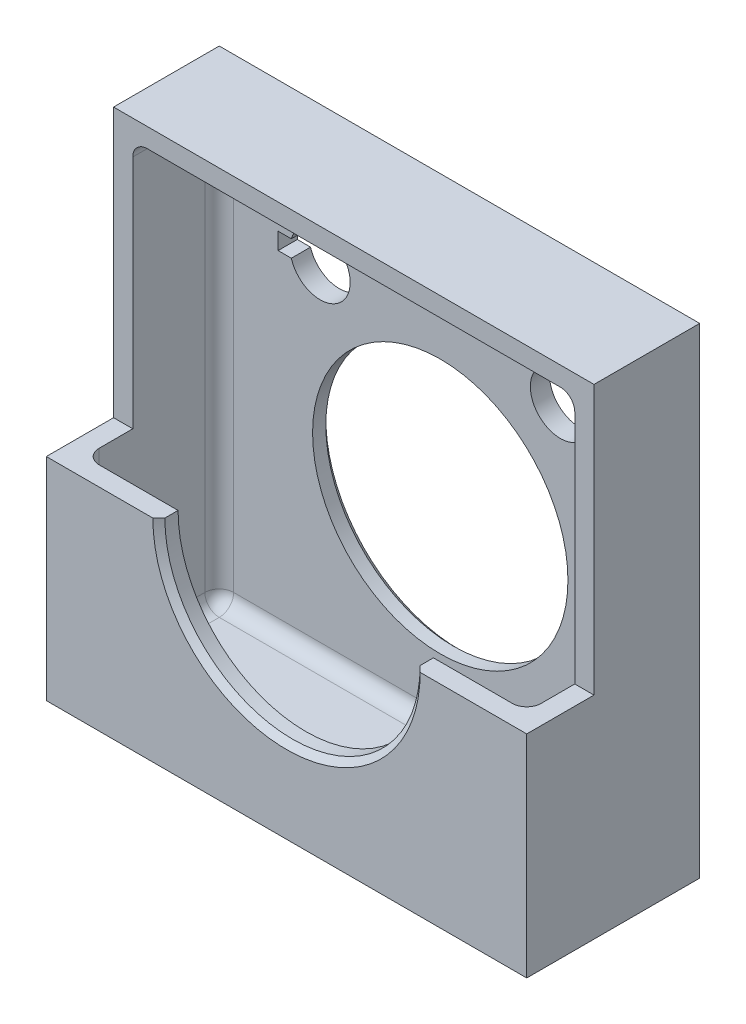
ISO-10303-21;
HEADER;
FILE_DESCRIPTION(('STEP AP214'),'2;1');
FILE_NAME('part.step','',(''),(''),'','','');
FILE_SCHEMA(('AUTOMOTIVE_DESIGN { 1 0 10303 214 1 1 1 1 }'));
ENDSEC;
DATA;
#1=APPLICATION_CONTEXT('core data for automotive mechanical design processes');
#2=APPLICATION_PROTOCOL_DEFINITION('international standard','automotive_design',2000,#1);
#3=PRODUCT_CONTEXT('',#1,'mechanical');
#4=PRODUCT('Part','Part','',(#3));
#5=PRODUCT_RELATED_PRODUCT_CATEGORY('part','',(#4));
#6=PRODUCT_DEFINITION_FORMATION('','',#4);
#7=PRODUCT_DEFINITION_CONTEXT('part definition',#1,'design');
#8=PRODUCT_DEFINITION('design','',#6,#7);
#9=PRODUCT_DEFINITION_SHAPE('','',#8);
#10=(LENGTH_UNIT() NAMED_UNIT(*) SI_UNIT(.MILLI.,.METRE.));
#11=(NAMED_UNIT(*) PLANE_ANGLE_UNIT() SI_UNIT($,.RADIAN.));
#12=(NAMED_UNIT(*) SI_UNIT($,.STERADIAN.) SOLID_ANGLE_UNIT());
#13=UNCERTAINTY_MEASURE_WITH_UNIT(LENGTH_MEASURE(1.E-05),#10,'distance_accuracy_value','');
#14=(GEOMETRIC_REPRESENTATION_CONTEXT(3) GLOBAL_UNCERTAINTY_ASSIGNED_CONTEXT((#13)) GLOBAL_UNIT_ASSIGNED_CONTEXT((#10,
#11,#12)) REPRESENTATION_CONTEXT('',''));
#15=CARTESIAN_POINT('',(0.,0.,0.));
#16=DIRECTION('',(0.,0.,1.));
#17=DIRECTION('',(1.,0.,0.));
#18=AXIS2_PLACEMENT_3D('',#15,#16,#17);
#19=CARTESIAN_POINT('',(0.,50.8,0.));
#20=DIRECTION('',(0.,0.,1.));
#21=DIRECTION('',(1.,0.,0.));
#22=AXIS2_PLACEMENT_3D('',#19,#20,#21);
#23=PLANE('',#22);
#24=DIRECTION('',(0.,1.,0.));
#25=VECTOR('',#24,1.);
#26=CARTESIAN_POINT('',(0.,0.,0.));
#27=LINE('',#26,#25);
#28=CARTESIAN_POINT('',(0.,0.,0.));
#29=VERTEX_POINT('',#28);
#30=CARTESIAN_POINT('',(0.,50.8,0.));
#31=VERTEX_POINT('',#30);
#32=EDGE_CURVE('E326',#29,#31,#27,.T.);
#33=ORIENTED_EDGE('',*,*,#32,.T.);
#34=DIRECTION('',(-1.,0.,0.));
#35=VECTOR('',#34,1.);
#36=CARTESIAN_POINT('',(50.8,50.8,0.));
#37=LINE('',#36,#35);
#38=CARTESIAN_POINT('',(50.8,50.8,0.));
#39=VERTEX_POINT('',#38);
#40=EDGE_CURVE('E346',#39,#31,#37,.T.);
#41=ORIENTED_EDGE('',*,*,#40,.F.);
#42=DIRECTION('',(0.,-1.,0.));
#43=VECTOR('',#42,1.);
#44=CARTESIAN_POINT('',(50.8,50.8,0.));
#45=LINE('',#44,#43);
#46=CARTESIAN_POINT('',(50.8,0.,0.));
#47=VERTEX_POINT('',#46);
#48=EDGE_CURVE('E349',#39,#47,#45,.T.);
#49=ORIENTED_EDGE('',*,*,#48,.T.);
#50=DIRECTION('',(1.,0.,0.));
#51=VECTOR('',#50,1.);
#52=CARTESIAN_POINT('',(0.,0.,0.));
#53=LINE('',#52,#51);
#54=EDGE_CURVE('E338',#29,#47,#53,.T.);
#55=ORIENTED_EDGE('',*,*,#54,.F.);
#56=EDGE_LOOP('',(#33,#41,#49,#55));
#57=FACE_BOUND('',#56,.T.);
#58=CARTESIAN_POINT('',(25.4,22.352,0.));
#59=DIRECTION('',(0.,0.,1.));
#60=DIRECTION('',(1.,0.,0.));
#61=AXIS2_PLACEMENT_3D('',#58,#59,#60);
#62=CIRCLE('',#61,14.1351);
#63=CARTESIAN_POINT('',(39.5351,22.352,0.));
#64=VERTEX_POINT('',#63);
#65=EDGE_CURVE('E477',#64,#64,#62,.T.);
#66=ORIENTED_EDGE('',*,*,#65,.T.);
#67=EDGE_LOOP('',(#66));
#68=FACE_BOUND('',#67,.T.);
#69=DIRECTION('',(1.,0.,0.));
#70=VECTOR('',#69,1.);
#71=CARTESIAN_POINT('',(8.255,37.211,5.6843418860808E-11));
#72=LINE('',#71,#70);
#73=CARTESIAN_POINT('',(8.255,37.211,5.6843418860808E-11));
#74=VERTEX_POINT('',#73);
#75=CARTESIAN_POINT('',(9.652,37.211,0.));
#76=VERTEX_POINT('',#75);
#77=EDGE_CURVE('E265',#74,#76,#72,.T.);
#78=ORIENTED_EDGE('',*,*,#77,.T.);
#79=CARTESIAN_POINT('',(12.7,38.1,5.6843418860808E-11));
#80=DIRECTION('',(0.,0.,-1.));
#81=DIRECTION('',(-1.,0.,0.));
#82=AXIS2_PLACEMENT_3D('',#79,#80,#81);
#83=CIRCLE('',#82,3.175);
#84=CARTESIAN_POINT('',(9.652,38.989,5.6843418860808E-11));
#85=VERTEX_POINT('',#84);
#86=EDGE_CURVE('E261',#85,#76,#83,.T.);
#87=ORIENTED_EDGE('',*,*,#86,.F.);
#88=DIRECTION('',(-1.,0.,0.));
#89=VECTOR('',#88,1.);
#90=CARTESIAN_POINT('',(9.652,38.989,5.6843418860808E-11));
#91=LINE('',#90,#89);
#92=CARTESIAN_POINT('',(8.255,38.989,5.6843418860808E-11));
#93=VERTEX_POINT('',#92);
#94=EDGE_CURVE('E271',#85,#93,#91,.T.);
#95=ORIENTED_EDGE('',*,*,#94,.T.);
#96=DIRECTION('',(0.,1.,0.));
#97=VECTOR('',#96,1.);
#98=CARTESIAN_POINT('',(8.255,37.211,5.6843418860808E-11));
#99=LINE('',#98,#97);
#100=EDGE_CURVE('E268',#74,#93,#99,.T.);
#101=ORIENTED_EDGE('',*,*,#100,.F.);
#102=EDGE_LOOP('',(#78,#87,#95,#101));
#103=FACE_BOUND('',#102,.T.);
#104=CARTESIAN_POINT('',(38.1,38.1,5.6843418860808E-11));
#105=DIRECTION('',(0.,0.,1.));
#106=DIRECTION('',(1.,0.,0.));
#107=AXIS2_PLACEMENT_3D('',#104,#105,#106);
#108=CIRCLE('',#107,3.175);
#109=CARTESIAN_POINT('',(41.148,38.989,0.));
#110=VERTEX_POINT('',#109);
#111=CARTESIAN_POINT('',(41.148,37.211,5.6843418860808E-11));
#112=VERTEX_POINT('',#111);
#113=EDGE_CURVE('E49',#110,#112,#108,.T.);
#114=ORIENTED_EDGE('',*,*,#113,.T.);
#115=DIRECTION('',(-1.,0.,0.));
#116=VECTOR('',#115,1.);
#117=CARTESIAN_POINT('',(42.545,37.211,5.6843418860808E-11));
#118=LINE('',#117,#116);
#119=CARTESIAN_POINT('',(42.545,37.211,5.6843418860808E-11));
#120=VERTEX_POINT('',#119);
#121=EDGE_CURVE('E254',#120,#112,#118,.T.);
#122=ORIENTED_EDGE('',*,*,#121,.F.);
#123=DIRECTION('',(0.,1.,0.));
#124=VECTOR('',#123,1.);
#125=CARTESIAN_POINT('',(42.545,37.211,5.6843418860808E-11));
#126=LINE('',#125,#124);
#127=CARTESIAN_POINT('',(42.545,38.989,5.6843418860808E-11));
#128=VERTEX_POINT('',#127);
#129=EDGE_CURVE('E240',#120,#128,#126,.T.);
#130=ORIENTED_EDGE('',*,*,#129,.T.);
#131=DIRECTION('',(1.,0.,0.));
#132=VECTOR('',#131,1.);
#133=CARTESIAN_POINT('',(41.148,38.989,5.6843418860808E-11));
#134=LINE('',#133,#132);
#135=EDGE_CURVE('E249',#110,#128,#134,.T.);
#136=ORIENTED_EDGE('',*,*,#135,.F.);
#137=EDGE_LOOP('',(#114,#122,#130,#136));
#138=FACE_BOUND('',#137,.T.);
#139=ADVANCED_FACE('F34',(#57,#68,#103,#138),#23,.F.);
#140=CARTESIAN_POINT('',(0.,50.8,2.032));
#141=DIRECTION('',(0.,0.,1.));
#142=DIRECTION('',(1.,0.,0.));
#143=AXIS2_PLACEMENT_3D('',#140,#141,#142);
#144=PLANE('',#143);
#145=CARTESIAN_POINT('',(25.4,22.352,2.032));
#146=DIRECTION('',(0.,0.,1.));
#147=DIRECTION('',(1.,0.,0.));
#148=AXIS2_PLACEMENT_3D('',#145,#146,#147);
#149=CIRCLE('',#148,13.5001);
#150=CARTESIAN_POINT('',(38.9001,22.352,2.032));
#151=VERTEX_POINT('',#150);
#152=EDGE_CURVE('E288',#151,#151,#149,.F.);
#153=ORIENTED_EDGE('',*,*,#152,.T.);
#154=EDGE_LOOP('',(#153));
#155=FACE_BOUND('',#154,.T.);
#156=DIRECTION('',(0.,1.,0.));
#157=VECTOR('',#156,1.);
#158=CARTESIAN_POINT('',(3.55600000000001,50.8,2.032));
#159=LINE('',#158,#157);
#160=CARTESIAN_POINT('',(3.55600000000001,47.244,2.032));
#161=VERTEX_POINT('',#160);
#162=CARTESIAN_POINT('',(3.556,3.556,2.032));
#163=VERTEX_POINT('',#162);
#164=EDGE_CURVE('E374',#161,#163,#159,.F.);
#165=ORIENTED_EDGE('',*,*,#164,.T.);
#166=DIRECTION('',(1.,0.,0.));
#167=VECTOR('',#166,1.);
#168=CARTESIAN_POINT('',(47.244,3.556,2.032));
#169=LINE('',#168,#167);
#170=CARTESIAN_POINT('',(47.244,3.556,2.032));
#171=VERTEX_POINT('',#170);
#172=EDGE_CURVE('E392',#163,#171,#169,.T.);
#173=ORIENTED_EDGE('',*,*,#172,.T.);
#174=DIRECTION('',(0.,-1.,0.));
#175=VECTOR('',#174,1.);
#176=CARTESIAN_POINT('',(47.244,50.8,2.032));
#177=LINE('',#176,#175);
#178=CARTESIAN_POINT('',(47.244,47.244,2.032));
#179=VERTEX_POINT('',#178);
#180=EDGE_CURVE('E377',#171,#179,#177,.F.);
#181=ORIENTED_EDGE('',*,*,#180,.T.);
#182=DIRECTION('',(-1.,0.,0.));
#183=VECTOR('',#182,1.);
#184=CARTESIAN_POINT('',(3.55600000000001,47.244,2.032));
#185=LINE('',#184,#183);
#186=EDGE_CURVE('E390',#179,#161,#185,.T.);
#187=ORIENTED_EDGE('',*,*,#186,.T.);
#188=EDGE_LOOP('',(#165,#173,#181,#187));
#189=FACE_BOUND('',#188,.T.);
#190=CARTESIAN_POINT('',(12.7,38.1,2.032));
#191=DIRECTION('',(0.,0.,1.));
#192=DIRECTION('',(1.,0.,0.));
#193=AXIS2_PLACEMENT_3D('',#190,#191,#192);
#194=CIRCLE('',#193,3.175);
#195=CARTESIAN_POINT('',(9.652,37.211,2.032));
#196=VERTEX_POINT('',#195);
#197=CARTESIAN_POINT('',(9.652,38.989,2.032));
#198=VERTEX_POINT('',#197);
#199=EDGE_CURVE('E492',#196,#198,#194,.T.);
#200=ORIENTED_EDGE('',*,*,#199,.F.);
#201=DIRECTION('',(-1.,0.,0.));
#202=VECTOR('',#201,1.);
#203=CARTESIAN_POINT('',(0.,37.211,2.032));
#204=LINE('',#203,#202);
#205=CARTESIAN_POINT('',(8.255,37.211,2.032));
#206=VERTEX_POINT('',#205);
#207=EDGE_CURVE('E483',#196,#206,#204,.T.);
#208=ORIENTED_EDGE('',*,*,#207,.T.);
#209=DIRECTION('',(0.,-1.,0.));
#210=VECTOR('',#209,1.);
#211=CARTESIAN_POINT('',(8.255,50.8,2.032));
#212=LINE('',#211,#210);
#213=CARTESIAN_POINT('',(8.255,38.989,2.032));
#214=VERTEX_POINT('',#213);
#215=EDGE_CURVE('E486',#214,#206,#212,.T.);
#216=ORIENTED_EDGE('',*,*,#215,.F.);
#217=DIRECTION('',(1.,0.,0.));
#218=VECTOR('',#217,1.);
#219=CARTESIAN_POINT('',(0.,38.989,2.032));
#220=LINE('',#219,#218);
#221=EDGE_CURVE('E489',#214,#198,#220,.T.);
#222=ORIENTED_EDGE('',*,*,#221,.T.);
#223=EDGE_LOOP('',(#200,#208,#216,#222));
#224=FACE_BOUND('',#223,.T.);
#225=DIRECTION('',(1.,0.,0.));
#226=VECTOR('',#225,1.);
#227=CARTESIAN_POINT('',(0.,37.211,2.032));
#228=LINE('',#227,#226);
#229=CARTESIAN_POINT('',(41.148,37.211,2.032));
#230=VERTEX_POINT('',#229);
#231=CARTESIAN_POINT('',(42.545,37.211,2.032));
#232=VERTEX_POINT('',#231);
#233=EDGE_CURVE('E42',#230,#232,#228,.T.);
#234=ORIENTED_EDGE('',*,*,#233,.F.);
#235=CARTESIAN_POINT('',(38.1,38.1,2.032));
#236=DIRECTION('',(0.,0.,1.));
#237=DIRECTION('',(1.,0.,0.));
#238=AXIS2_PLACEMENT_3D('',#235,#236,#237);
#239=CIRCLE('',#238,3.175);
#240=CARTESIAN_POINT('',(41.148,38.989,2.032));
#241=VERTEX_POINT('',#240);
#242=EDGE_CURVE('E11',#230,#241,#239,.F.);
#243=ORIENTED_EDGE('',*,*,#242,.T.);
#244=DIRECTION('',(-1.,0.,0.));
#245=VECTOR('',#244,1.);
#246=CARTESIAN_POINT('',(0.,38.989,2.032));
#247=LINE('',#246,#245);
#248=CARTESIAN_POINT('',(42.545,38.989,2.032));
#249=VERTEX_POINT('',#248);
#250=EDGE_CURVE('E494',#249,#241,#247,.T.);
#251=ORIENTED_EDGE('',*,*,#250,.F.);
#252=DIRECTION('',(0.,-1.,0.));
#253=VECTOR('',#252,1.);
#254=CARTESIAN_POINT('',(42.545,50.8,2.032));
#255=LINE('',#254,#253);
#256=EDGE_CURVE('E243',#249,#232,#255,.T.);
#257=ORIENTED_EDGE('',*,*,#256,.T.);
#258=EDGE_LOOP('',(#234,#243,#251,#257));
#259=FACE_BOUND('',#258,.T.);
#260=ADVANCED_FACE('F501',(#155,#189,#224,#259),#144,.T.);
#261=CARTESIAN_POINT('',(0.,22.352,11.176));
#262=DIRECTION('',(0.,1.,0.));
#263=DIRECTION('',(0.,0.,1.));
#264=AXIS2_PLACEMENT_3D('',#261,#262,#263);
#265=PLANE('',#264);
#266=DIRECTION('',(0.,0.,-1.));
#267=VECTOR('',#266,1.);
#268=CARTESIAN_POINT('',(38.9001,22.352,18.288));
#269=LINE('',#268,#267);
#270=CARTESIAN_POINT('',(38.9001,22.352,16.256));
#271=VERTEX_POINT('',#270);
#272=CARTESIAN_POINT('',(38.9001,22.352,17.653));
#273=VERTEX_POINT('',#272);
#274=EDGE_CURVE('E290',#271,#273,#269,.F.);
#275=ORIENTED_EDGE('',*,*,#274,.T.);
#276=DIRECTION('',(-0.707106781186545,0.,-0.70710678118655));
#277=VECTOR('',#276,1.);
#278=CARTESIAN_POINT('',(25.4,22.352,4.15289999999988));
#279=LINE('',#278,#277);
#280=CARTESIAN_POINT('',(39.5351,22.352,18.288));
#281=VERTEX_POINT('',#280);
#282=EDGE_CURVE('E471',#273,#281,#279,.F.);
#283=ORIENTED_EDGE('',*,*,#282,.T.);
#284=DIRECTION('',(1.,0.,0.));
#285=VECTOR('',#284,1.);
#286=CARTESIAN_POINT('',(0.,22.352,18.288));
#287=LINE('',#286,#285);
#288=CARTESIAN_POINT('',(50.8,22.352,18.288));
#289=VERTEX_POINT('',#288);
#290=EDGE_CURVE('E319',#281,#289,#287,.T.);
#291=ORIENTED_EDGE('',*,*,#290,.T.);
#292=DIRECTION('',(0.,0.,1.));
#293=VECTOR('',#292,1.);
#294=CARTESIAN_POINT('',(50.8,22.352,11.176));
#295=LINE('',#294,#293);
#296=CARTESIAN_POINT('',(50.8,22.352,11.176));
#297=VERTEX_POINT('',#296);
#298=EDGE_CURVE('E307',#297,#289,#295,.T.);
#299=ORIENTED_EDGE('',*,*,#298,.F.);
#300=DIRECTION('',(1.,0.,0.));
#301=VECTOR('',#300,1.);
#302=CARTESIAN_POINT('',(0.,22.352,11.176));
#303=LINE('',#302,#301);
#304=CARTESIAN_POINT('',(48.768,22.352,11.176));
#305=VERTEX_POINT('',#304);
#306=EDGE_CURVE('E330',#305,#297,#303,.T.);
#307=ORIENTED_EDGE('',*,*,#306,.F.);
#308=DIRECTION('',(0.,0.,1.));
#309=VECTOR('',#308,1.);
#310=CARTESIAN_POINT('',(48.768,22.352,18.288));
#311=LINE('',#310,#309);
#312=CARTESIAN_POINT('',(48.768,22.352,14.732));
#313=VERTEX_POINT('',#312);
#314=EDGE_CURVE('E293',#305,#313,#311,.T.);
#315=ORIENTED_EDGE('',*,*,#314,.T.);
#316=CARTESIAN_POINT('',(47.244,22.352,14.732));
#317=DIRECTION('',(0.,1.,0.));
#318=DIRECTION('',(0.,0.,1.));
#319=AXIS2_PLACEMENT_3D('',#316,#317,#318);
#320=CIRCLE('',#319,1.524);
#321=CARTESIAN_POINT('',(47.244,22.352,16.256));
#322=VERTEX_POINT('',#321);
#323=EDGE_CURVE('E386',#313,#322,#320,.F.);
#324=ORIENTED_EDGE('',*,*,#323,.T.);
#325=DIRECTION('',(1.,0.,0.));
#326=VECTOR('',#325,1.);
#327=CARTESIAN_POINT('',(0.,22.352,16.256));
#328=LINE('',#327,#326);
#329=EDGE_CURVE('E298',#271,#322,#328,.T.);
#330=ORIENTED_EDGE('',*,*,#329,.F.);
#331=EDGE_LOOP('',(#275,#283,#291,#299,#307,#315,#324,#330));
#332=FACE_BOUND('',#331,.T.);
#333=ADVANCED_FACE('F522',(#332),#265,.T.);
#334=CARTESIAN_POINT('',(0.,22.352,18.288));
#335=VERTEX_POINT('',#334);
#336=CARTESIAN_POINT('',(11.2649,22.352,18.288));
#337=VERTEX_POINT('',#336);
#338=EDGE_CURVE('E331',#335,#337,#287,.T.);
#339=ORIENTED_EDGE('',*,*,#338,.T.);
#340=DIRECTION('',(-0.707106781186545,0.,0.70710678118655));
#341=VECTOR('',#340,1.);
#342=CARTESIAN_POINT('',(25.4,22.352,4.15289999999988));
#343=LINE('',#342,#341);
#344=CARTESIAN_POINT('',(11.8999,22.352,17.653));
#345=VERTEX_POINT('',#344);
#346=EDGE_CURVE('E475',#337,#345,#343,.F.);
#347=ORIENTED_EDGE('',*,*,#346,.T.);
#348=DIRECTION('',(0.,0.,-1.));
#349=VECTOR('',#348,1.);
#350=CARTESIAN_POINT('',(11.8999,22.352,18.288));
#351=LINE('',#350,#349);
#352=CARTESIAN_POINT('',(11.8999,22.352,16.256));
#353=VERTEX_POINT('',#352);
#354=EDGE_CURVE('E287',#345,#353,#351,.T.);
#355=ORIENTED_EDGE('',*,*,#354,.T.);
#356=CARTESIAN_POINT('',(3.556,22.352,16.256));
#357=VERTEX_POINT('',#356);
#358=EDGE_CURVE('E294',#357,#353,#328,.T.);
#359=ORIENTED_EDGE('',*,*,#358,.F.);
#360=CARTESIAN_POINT('',(3.556,22.352,14.732));
#361=DIRECTION('',(0.,1.,0.));
#362=DIRECTION('',(0.,0.,1.));
#363=AXIS2_PLACEMENT_3D('',#360,#361,#362);
#364=CIRCLE('',#363,1.524);
#365=CARTESIAN_POINT('',(2.032,22.352,14.732));
#366=VERTEX_POINT('',#365);
#367=EDGE_CURVE('E388',#357,#366,#364,.F.);
#368=ORIENTED_EDGE('',*,*,#367,.T.);
#369=DIRECTION('',(0.,0.,1.));
#370=VECTOR('',#369,1.);
#371=CARTESIAN_POINT('',(2.032,22.352,11.176));
#372=LINE('',#371,#370);
#373=CARTESIAN_POINT('',(2.032,22.352,11.176));
#374=VERTEX_POINT('',#373);
#375=EDGE_CURVE('E304',#374,#366,#372,.T.);
#376=ORIENTED_EDGE('',*,*,#375,.F.);
#377=CARTESIAN_POINT('',(0.,22.352,11.176));
#378=VERTEX_POINT('',#377);
#379=EDGE_CURVE('E327',#378,#374,#303,.T.);
#380=ORIENTED_EDGE('',*,*,#379,.F.);
#381=DIRECTION('',(0.,0.,1.));
#382=VECTOR('',#381,1.);
#383=CARTESIAN_POINT('',(0.,22.352,11.176));
#384=LINE('',#383,#382);
#385=EDGE_CURVE('E313',#378,#335,#384,.T.);
#386=ORIENTED_EDGE('',*,*,#385,.T.);
#387=EDGE_LOOP('',(#339,#347,#355,#359,#368,#376,#380,#386));
#388=FACE_BOUND('',#387,.T.);
#389=ADVANCED_FACE('F629',(#388),#265,.T.);
#390=CARTESIAN_POINT('',(0.,50.8,18.288));
#391=DIRECTION('',(0.,0.,1.));
#392=DIRECTION('',(1.,0.,0.));
#393=AXIS2_PLACEMENT_3D('',#390,#391,#392);
#394=PLANE('',#393);
#395=ORIENTED_EDGE('',*,*,#290,.F.);
#396=CARTESIAN_POINT('',(25.4,22.352,18.288));
#397=DIRECTION('',(0.,0.,1.));
#398=DIRECTION('',(1.,0.,0.));
#399=AXIS2_PLACEMENT_3D('',#396,#397,#398);
#400=CIRCLE('',#399,14.1351);
#401=EDGE_CURVE('E473',#281,#337,#400,.F.);
#402=ORIENTED_EDGE('',*,*,#401,.T.);
#403=ORIENTED_EDGE('',*,*,#338,.F.);
#404=DIRECTION('',(0.,1.,0.));
#405=VECTOR('',#404,1.);
#406=CARTESIAN_POINT('',(0.,0.,18.288));
#407=LINE('',#406,#405);
#408=CARTESIAN_POINT('',(0.,0.,18.288));
#409=VERTEX_POINT('',#408);
#410=EDGE_CURVE('E334',#409,#335,#407,.T.);
#411=ORIENTED_EDGE('',*,*,#410,.F.);
#412=DIRECTION('',(1.,0.,0.));
#413=VECTOR('',#412,1.);
#414=CARTESIAN_POINT('',(0.,0.,18.288));
#415=LINE('',#414,#413);
#416=CARTESIAN_POINT('',(50.8,0.,18.288));
#417=VERTEX_POINT('',#416);
#418=EDGE_CURVE('E340',#409,#417,#415,.T.);
#419=ORIENTED_EDGE('',*,*,#418,.T.);
#420=DIRECTION('',(0.,-1.,0.));
#421=VECTOR('',#420,1.);
#422=CARTESIAN_POINT('',(50.8,50.8,18.288));
#423=LINE('',#422,#421);
#424=EDGE_CURVE('E337',#289,#417,#423,.T.);
#425=ORIENTED_EDGE('',*,*,#424,.F.);
#426=EDGE_LOOP('',(#395,#402,#403,#411,#419,#425));
#427=FACE_BOUND('',#426,.T.);
#428=ADVANCED_FACE('F528',(#427),#394,.T.);
#429=CARTESIAN_POINT('',(0.,50.8,16.256));
#430=DIRECTION('',(0.,0.,1.));
#431=DIRECTION('',(1.,0.,0.));
#432=AXIS2_PLACEMENT_3D('',#429,#430,#431);
#433=PLANE('',#432);
#434=DIRECTION('',(0.,-1.,0.));
#435=VECTOR('',#434,1.);
#436=CARTESIAN_POINT('',(47.244,2.032,16.256));
#437=LINE('',#436,#435);
#438=CARTESIAN_POINT('',(47.244,3.556,16.256));
#439=VERTEX_POINT('',#438);
#440=EDGE_CURVE('E366',#322,#439,#437,.T.);
#441=ORIENTED_EDGE('',*,*,#440,.T.);
#442=DIRECTION('',(1.,0.,0.));
#443=VECTOR('',#442,1.);
#444=CARTESIAN_POINT('',(0.,3.556,16.256));
#445=LINE('',#444,#443);
#446=CARTESIAN_POINT('',(3.556,3.556,16.256));
#447=VERTEX_POINT('',#446);
#448=EDGE_CURVE('E431',#439,#447,#445,.F.);
#449=ORIENTED_EDGE('',*,*,#448,.T.);
#450=DIRECTION('',(0.,1.,0.));
#451=VECTOR('',#450,1.);
#452=CARTESIAN_POINT('',(3.556,22.352,16.256));
#453=LINE('',#452,#451);
#454=EDGE_CURVE('E356',#447,#357,#453,.T.);
#455=ORIENTED_EDGE('',*,*,#454,.T.);
#456=ORIENTED_EDGE('',*,*,#358,.T.);
#457=CARTESIAN_POINT('',(25.4,22.352,16.256));
#458=DIRECTION('',(0.,0.,1.));
#459=DIRECTION('',(1.,0.,0.));
#460=AXIS2_PLACEMENT_3D('',#457,#458,#459);
#461=CIRCLE('',#460,13.5001);
#462=EDGE_CURVE('E284',#271,#353,#461,.F.);
#463=ORIENTED_EDGE('',*,*,#462,.F.);
#464=ORIENTED_EDGE('',*,*,#329,.T.);
#465=EDGE_LOOP('',(#441,#449,#455,#456,#463,#464));
#466=FACE_BOUND('',#465,.T.);
#467=ADVANCED_FACE('F637',(#466),#433,.F.);
#468=CARTESIAN_POINT('',(0.,22.352,11.176));
#469=DIRECTION('',(0.,0.,-1.));
#470=DIRECTION('',(-1.,0.,0.));
#471=AXIS2_PLACEMENT_3D('',#468,#469,#470);
#472=PLANE('',#471);
#473=DIRECTION('',(0.,1.,0.));
#474=VECTOR('',#473,1.);
#475=CARTESIAN_POINT('',(48.768,50.8,11.176));
#476=LINE('',#475,#474);
#477=CARTESIAN_POINT('',(48.768,47.244,11.176));
#478=VERTEX_POINT('',#477);
#479=EDGE_CURVE('E301',#305,#478,#476,.T.);
#480=ORIENTED_EDGE('',*,*,#479,.F.);
#481=ORIENTED_EDGE('',*,*,#306,.T.);
#482=DIRECTION('',(0.,1.,0.));
#483=VECTOR('',#482,1.);
#484=CARTESIAN_POINT('',(50.8,22.352,11.176));
#485=LINE('',#484,#483);
#486=CARTESIAN_POINT('',(50.8,50.8,11.176));
#487=VERTEX_POINT('',#486);
#488=EDGE_CURVE('E316',#297,#487,#485,.T.);
#489=ORIENTED_EDGE('',*,*,#488,.T.);
#490=DIRECTION('',(1.,0.,0.));
#491=VECTOR('',#490,1.);
#492=CARTESIAN_POINT('',(0.,50.8,11.176));
#493=LINE('',#492,#491);
#494=CARTESIAN_POINT('',(0.,50.8,11.176));
#495=VERTEX_POINT('',#494);
#496=EDGE_CURVE('E323',#495,#487,#493,.T.);
#497=ORIENTED_EDGE('',*,*,#496,.F.);
#498=DIRECTION('',(0.,1.,0.));
#499=VECTOR('',#498,1.);
#500=CARTESIAN_POINT('',(0.,22.352,11.176));
#501=LINE('',#500,#499);
#502=EDGE_CURVE('E315',#378,#495,#501,.T.);
#503=ORIENTED_EDGE('',*,*,#502,.F.);
#504=ORIENTED_EDGE('',*,*,#379,.T.);
#505=DIRECTION('',(0.,1.,0.));
#506=VECTOR('',#505,1.);
#507=CARTESIAN_POINT('',(2.032,22.352,11.176));
#508=LINE('',#507,#506);
#509=CARTESIAN_POINT('',(2.03200000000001,47.244,11.176));
#510=VERTEX_POINT('',#509);
#511=EDGE_CURVE('E308',#374,#510,#508,.T.);
#512=ORIENTED_EDGE('',*,*,#511,.T.);
#513=CARTESIAN_POINT('',(3.55600000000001,47.244,11.176));
#514=DIRECTION('',(0.,0.,-1.));
#515=DIRECTION('',(-1.,0.,0.));
#516=AXIS2_PLACEMENT_3D('',#513,#514,#515);
#517=CIRCLE('',#516,1.524);
#518=CARTESIAN_POINT('',(3.55600000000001,48.768,11.176));
#519=VERTEX_POINT('',#518);
#520=EDGE_CURVE('E435',#510,#519,#517,.T.);
#521=ORIENTED_EDGE('',*,*,#520,.T.);
#522=DIRECTION('',(1.,0.,0.));
#523=VECTOR('',#522,1.);
#524=CARTESIAN_POINT('',(50.8,48.768,11.176));
#525=LINE('',#524,#523);
#526=CARTESIAN_POINT('',(47.244,48.768,11.176));
#527=VERTEX_POINT('',#526);
#528=EDGE_CURVE('E297',#519,#527,#525,.T.);
#529=ORIENTED_EDGE('',*,*,#528,.T.);
#530=CARTESIAN_POINT('',(47.244,47.244,11.176));
#531=DIRECTION('',(0.,0.,-1.));
#532=DIRECTION('',(-1.,0.,0.));
#533=AXIS2_PLACEMENT_3D('',#530,#531,#532);
#534=CIRCLE('',#533,1.524);
#535=EDGE_CURVE('E433',#527,#478,#534,.T.);
#536=ORIENTED_EDGE('',*,*,#535,.T.);
#537=EDGE_LOOP('',(#480,#481,#489,#497,#503,#504,#512,#521,#529,#536));
#538=FACE_BOUND('',#537,.T.);
#539=ADVANCED_FACE('F546',(#538),#472,.F.);
#540=CARTESIAN_POINT('',(0.,0.,18.288));
#541=DIRECTION('',(-1.,0.,0.));
#542=DIRECTION('',(0.,-1.,0.));
#543=AXIS2_PLACEMENT_3D('',#540,#541,#542);
#544=PLANE('',#543);
#545=ORIENTED_EDGE('',*,*,#502,.T.);
#546=DIRECTION('',(0.,0.,-1.));
#547=VECTOR('',#546,1.);
#548=CARTESIAN_POINT('',(0.,50.8,18.288));
#549=LINE('',#548,#547);
#550=EDGE_CURVE('E343',#495,#31,#549,.T.);
#551=ORIENTED_EDGE('',*,*,#550,.T.);
#552=ORIENTED_EDGE('',*,*,#32,.F.);
#553=DIRECTION('',(0.,0.,-1.));
#554=VECTOR('',#553,1.);
#555=CARTESIAN_POINT('',(0.,0.,18.288));
#556=LINE('',#555,#554);
#557=EDGE_CURVE('E354',#409,#29,#556,.T.);
#558=ORIENTED_EDGE('',*,*,#557,.F.);
#559=ORIENTED_EDGE('',*,*,#410,.T.);
#560=ORIENTED_EDGE('',*,*,#385,.F.);
#561=EDGE_LOOP('',(#545,#551,#552,#558,#559,#560));
#562=FACE_BOUND('',#561,.T.);
#563=ADVANCED_FACE('F534',(#562),#544,.T.);
#564=CARTESIAN_POINT('',(0.,0.,18.288));
#565=DIRECTION('',(0.,1.,0.));
#566=DIRECTION('',(0.,0.,1.));
#567=AXIS2_PLACEMENT_3D('',#564,#565,#566);
#568=PLANE('',#567);
#569=ORIENTED_EDGE('',*,*,#54,.T.);
#570=DIRECTION('',(0.,0.,-1.));
#571=VECTOR('',#570,1.);
#572=CARTESIAN_POINT('',(50.8,0.,18.288));
#573=LINE('',#572,#571);
#574=EDGE_CURVE('E357',#417,#47,#573,.T.);
#575=ORIENTED_EDGE('',*,*,#574,.F.);
#576=ORIENTED_EDGE('',*,*,#418,.F.);
#577=ORIENTED_EDGE('',*,*,#557,.T.);
#578=EDGE_LOOP('',(#569,#575,#576,#577));
#579=FACE_BOUND('',#578,.T.);
#580=ADVANCED_FACE('F530',(#579),#568,.F.);
#581=CARTESIAN_POINT('',(50.8,50.8,18.288));
#582=DIRECTION('',(1.,0.,0.));
#583=DIRECTION('',(0.,1.,0.));
#584=AXIS2_PLACEMENT_3D('',#581,#582,#583);
#585=PLANE('',#584);
#586=ORIENTED_EDGE('',*,*,#488,.F.);
#587=ORIENTED_EDGE('',*,*,#298,.T.);
#588=ORIENTED_EDGE('',*,*,#424,.T.);
#589=ORIENTED_EDGE('',*,*,#574,.T.);
#590=ORIENTED_EDGE('',*,*,#48,.F.);
#591=DIRECTION('',(0.,0.,-1.));
#592=VECTOR('',#591,1.);
#593=CARTESIAN_POINT('',(50.8,50.8,18.288));
#594=LINE('',#593,#592);
#595=EDGE_CURVE('E359',#487,#39,#594,.T.);
#596=ORIENTED_EDGE('',*,*,#595,.F.);
#597=EDGE_LOOP('',(#586,#587,#588,#589,#590,#596));
#598=FACE_BOUND('',#597,.T.);
#599=ADVANCED_FACE('F533',(#598),#585,.T.);
#600=CARTESIAN_POINT('',(50.8,50.8,18.288));
#601=DIRECTION('',(0.,-1.,0.));
#602=DIRECTION('',(0.,0.,-1.));
#603=AXIS2_PLACEMENT_3D('',#600,#601,#602);
#604=PLANE('',#603);
#605=ORIENTED_EDGE('',*,*,#550,.F.);
#606=ORIENTED_EDGE('',*,*,#496,.T.);
#607=ORIENTED_EDGE('',*,*,#595,.T.);
#608=ORIENTED_EDGE('',*,*,#40,.T.);
#609=EDGE_LOOP('',(#605,#606,#607,#608));
#610=FACE_BOUND('',#609,.T.);
#611=ADVANCED_FACE('F538',(#610),#604,.F.);
#612=CARTESIAN_POINT('',(2.032,0.,18.288));
#613=DIRECTION('',(-1.,0.,0.));
#614=DIRECTION('',(0.,-1.,0.));
#615=AXIS2_PLACEMENT_3D('',#612,#613,#614);
#616=PLANE('',#615);
#617=DIRECTION('',(0.,1.,0.));
#618=VECTOR('',#617,1.);
#619=CARTESIAN_POINT('',(2.032,0.,3.556));
#620=LINE('',#619,#618);
#621=CARTESIAN_POINT('',(2.032,3.556,3.556));
#622=VERTEX_POINT('',#621);
#623=CARTESIAN_POINT('',(2.03200000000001,47.244,3.556));
#624=VERTEX_POINT('',#623);
#625=EDGE_CURVE('E383',#622,#624,#620,.T.);
#626=ORIENTED_EDGE('',*,*,#625,.T.);
#627=DIRECTION('',(0.,0.,-1.));
#628=VECTOR('',#627,1.);
#629=CARTESIAN_POINT('',(2.03200000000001,47.244,18.288));
#630=LINE('',#629,#628);
#631=EDGE_CURVE('E425',#624,#510,#630,.F.);
#632=ORIENTED_EDGE('',*,*,#631,.T.);
#633=ORIENTED_EDGE('',*,*,#511,.F.);
#634=ORIENTED_EDGE('',*,*,#375,.T.);
#635=DIRECTION('',(0.,1.,0.));
#636=VECTOR('',#635,1.);
#637=CARTESIAN_POINT('',(2.032,2.032,14.732));
#638=LINE('',#637,#636);
#639=CARTESIAN_POINT('',(2.032,3.556,14.732));
#640=VERTEX_POINT('',#639);
#641=EDGE_CURVE('E380',#366,#640,#638,.F.);
#642=ORIENTED_EDGE('',*,*,#641,.T.);
#643=DIRECTION('',(0.,0.,-1.));
#644=VECTOR('',#643,1.);
#645=CARTESIAN_POINT('',(2.032,3.556,18.288));
#646=LINE('',#645,#644);
#647=EDGE_CURVE('E423',#640,#622,#646,.T.);
#648=ORIENTED_EDGE('',*,*,#647,.T.);
#649=EDGE_LOOP('',(#626,#632,#633,#634,#642,#648));
#650=FACE_BOUND('',#649,.T.);
#651=ADVANCED_FACE('F542',(#650),#616,.F.);
#652=CARTESIAN_POINT('',(0.,2.032,18.288));
#653=DIRECTION('',(0.,1.,0.));
#654=DIRECTION('',(0.,0.,1.));
#655=AXIS2_PLACEMENT_3D('',#652,#653,#654);
#656=PLANE('',#655);
#657=DIRECTION('',(0.,0.,-1.));
#658=VECTOR('',#657,1.);
#659=CARTESIAN_POINT('',(47.244,2.032,18.288));
#660=LINE('',#659,#658);
#661=CARTESIAN_POINT('',(47.244,2.032,14.732));
#662=VERTEX_POINT('',#661);
#663=CARTESIAN_POINT('',(47.244,2.032,3.556));
#664=VERTEX_POINT('',#663);
#665=EDGE_CURVE('E397',#662,#664,#660,.T.);
#666=ORIENTED_EDGE('',*,*,#665,.T.);
#667=DIRECTION('',(1.,0.,0.));
#668=VECTOR('',#667,1.);
#669=CARTESIAN_POINT('',(3.556,2.032,3.556));
#670=LINE('',#669,#668);
#671=CARTESIAN_POINT('',(3.556,2.032,3.556));
#672=VERTEX_POINT('',#671);
#673=EDGE_CURVE('E401',#664,#672,#670,.F.);
#674=ORIENTED_EDGE('',*,*,#673,.T.);
#675=DIRECTION('',(0.,0.,-1.));
#676=VECTOR('',#675,1.);
#677=CARTESIAN_POINT('',(3.556,2.032,18.288));
#678=LINE('',#677,#676);
#679=CARTESIAN_POINT('',(3.556,2.032,14.732));
#680=VERTEX_POINT('',#679);
#681=EDGE_CURVE('E399',#672,#680,#678,.F.);
#682=ORIENTED_EDGE('',*,*,#681,.T.);
#683=DIRECTION('',(1.,0.,0.));
#684=VECTOR('',#683,1.);
#685=CARTESIAN_POINT('',(0.,2.032,14.732));
#686=LINE('',#685,#684);
#687=EDGE_CURVE('E395',#680,#662,#686,.T.);
#688=ORIENTED_EDGE('',*,*,#687,.T.);
#689=EDGE_LOOP('',(#666,#674,#682,#688));
#690=FACE_BOUND('',#689,.T.);
#691=ADVANCED_FACE('F656',(#690),#656,.T.);
#692=CARTESIAN_POINT('',(48.768,50.8,18.288));
#693=DIRECTION('',(1.,0.,0.));
#694=DIRECTION('',(0.,1.,0.));
#695=AXIS2_PLACEMENT_3D('',#692,#693,#694);
#696=PLANE('',#695);
#697=ORIENTED_EDGE('',*,*,#479,.T.);
#698=DIRECTION('',(0.,0.,-1.));
#699=VECTOR('',#698,1.);
#700=CARTESIAN_POINT('',(48.768,47.244,18.288));
#701=LINE('',#700,#699);
#702=CARTESIAN_POINT('',(48.768,47.244,3.556));
#703=VERTEX_POINT('',#702);
#704=EDGE_CURVE('E414',#478,#703,#701,.T.);
#705=ORIENTED_EDGE('',*,*,#704,.T.);
#706=DIRECTION('',(0.,-1.,0.));
#707=VECTOR('',#706,1.);
#708=CARTESIAN_POINT('',(48.768,50.8,3.556));
#709=LINE('',#708,#707);
#710=CARTESIAN_POINT('',(48.768,3.556,3.556));
#711=VERTEX_POINT('',#710);
#712=EDGE_CURVE('E369',#703,#711,#709,.T.);
#713=ORIENTED_EDGE('',*,*,#712,.T.);
#714=DIRECTION('',(0.,0.,-1.));
#715=VECTOR('',#714,1.);
#716=CARTESIAN_POINT('',(48.768,3.556,18.288));
#717=LINE('',#716,#715);
#718=CARTESIAN_POINT('',(48.768,3.556,14.732));
#719=VERTEX_POINT('',#718);
#720=EDGE_CURVE('E412',#711,#719,#717,.F.);
#721=ORIENTED_EDGE('',*,*,#720,.T.);
#722=DIRECTION('',(0.,-1.,0.));
#723=VECTOR('',#722,1.);
#724=CARTESIAN_POINT('',(48.768,22.352,14.732));
#725=LINE('',#724,#723);
#726=EDGE_CURVE('E372',#719,#313,#725,.F.);
#727=ORIENTED_EDGE('',*,*,#726,.T.);
#728=ORIENTED_EDGE('',*,*,#314,.F.);
#729=EDGE_LOOP('',(#697,#705,#713,#721,#727,#728));
#730=FACE_BOUND('',#729,.T.);
#731=ADVANCED_FACE('F700',(#730),#696,.F.);
#732=CARTESIAN_POINT('',(50.8,48.768,18.288));
#733=DIRECTION('',(0.,-1.,0.));
#734=DIRECTION('',(0.,0.,-1.));
#735=AXIS2_PLACEMENT_3D('',#732,#733,#734);
#736=PLANE('',#735);
#737=DIRECTION('',(-1.,0.,0.));
#738=VECTOR('',#737,1.);
#739=CARTESIAN_POINT('',(47.244,48.768,3.556));
#740=LINE('',#739,#738);
#741=CARTESIAN_POINT('',(3.55600000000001,48.768,3.556));
#742=VERTEX_POINT('',#741);
#743=CARTESIAN_POINT('',(47.244,48.768,3.556));
#744=VERTEX_POINT('',#743);
#745=EDGE_CURVE('E417',#742,#744,#740,.F.);
#746=ORIENTED_EDGE('',*,*,#745,.T.);
#747=DIRECTION('',(0.,0.,-1.));
#748=VECTOR('',#747,1.);
#749=CARTESIAN_POINT('',(47.244,48.768,18.288));
#750=LINE('',#749,#748);
#751=EDGE_CURVE('E421',#744,#527,#750,.F.);
#752=ORIENTED_EDGE('',*,*,#751,.T.);
#753=ORIENTED_EDGE('',*,*,#528,.F.);
#754=DIRECTION('',(0.,0.,-1.));
#755=VECTOR('',#754,1.);
#756=CARTESIAN_POINT('',(3.55600000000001,48.768,18.288));
#757=LINE('',#756,#755);
#758=EDGE_CURVE('E419',#519,#742,#757,.T.);
#759=ORIENTED_EDGE('',*,*,#758,.T.);
#760=EDGE_LOOP('',(#746,#752,#753,#759));
#761=FACE_BOUND('',#760,.T.);
#762=ADVANCED_FACE('F675',(#761),#736,.T.);
#763=CARTESIAN_POINT('',(25.4,22.352,18.288));
#764=DIRECTION('',(0.,0.,-1.));
#765=DIRECTION('',(-1.,0.,0.));
#766=AXIS2_PLACEMENT_3D('',#763,#764,#765);
#767=CYLINDRICAL_SURFACE('',#766,13.5001);
#768=CARTESIAN_POINT('',(25.4,22.352,0.635000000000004));
#769=DIRECTION('',(0.,0.,1.));
#770=DIRECTION('',(1.,0.,0.));
#771=AXIS2_PLACEMENT_3D('',#768,#769,#770);
#772=CIRCLE('',#771,13.5001);
#773=CARTESIAN_POINT('',(38.9001,22.352,0.635000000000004));
#774=VERTEX_POINT('',#773);
#775=EDGE_CURVE('E480',#774,#774,#772,.F.);
#776=ORIENTED_EDGE('',*,*,#775,.T.);
#777=EDGE_LOOP('',(#776));
#778=FACE_BOUND('',#777,.T.);
#779=ORIENTED_EDGE('',*,*,#152,.F.);
#780=EDGE_LOOP('',(#779));
#781=FACE_BOUND('',#780,.T.);
#782=ADVANCED_FACE('F733',(#778,#781),#767,.F.);
#783=ORIENTED_EDGE('',*,*,#354,.F.);
#784=CARTESIAN_POINT('',(25.4,22.352,17.653));
#785=DIRECTION('',(0.,0.,1.));
#786=DIRECTION('',(1.,0.,0.));
#787=AXIS2_PLACEMENT_3D('',#784,#785,#786);
#788=CIRCLE('',#787,13.5001);
#789=EDGE_CURVE('E437',#345,#273,#788,.T.);
#790=ORIENTED_EDGE('',*,*,#789,.T.);
#791=ORIENTED_EDGE('',*,*,#274,.F.);
#792=ORIENTED_EDGE('',*,*,#462,.T.);
#793=EDGE_LOOP('',(#783,#790,#791,#792));
#794=FACE_BOUND('',#793,.T.);
#795=ADVANCED_FACE('F552',(#794),#767,.F.);
#796=CARTESIAN_POINT('',(47.244,50.8,14.732));
#797=DIRECTION('',(0.,1.,0.));
#798=DIRECTION('',(-1.,0.,0.));
#799=AXIS2_PLACEMENT_3D('',#796,#797,#798);
#800=CYLINDRICAL_SURFACE('',#799,1.524);
#801=ORIENTED_EDGE('',*,*,#726,.F.);
#802=CARTESIAN_POINT('',(47.244,3.556,14.732));
#803=DIRECTION('',(0.,1.,0.));
#804=DIRECTION('',(-1.,0.,0.));
#805=AXIS2_PLACEMENT_3D('',#802,#803,#804);
#806=CIRCLE('',#805,1.524);
#807=EDGE_CURVE('E429',#719,#439,#806,.F.);
#808=ORIENTED_EDGE('',*,*,#807,.T.);
#809=ORIENTED_EDGE('',*,*,#440,.F.);
#810=ORIENTED_EDGE('',*,*,#323,.F.);
#811=EDGE_LOOP('',(#801,#808,#809,#810));
#812=FACE_BOUND('',#811,.T.);
#813=ADVANCED_FACE('F548',(#812),#800,.F.);
#814=CARTESIAN_POINT('',(47.244,50.8,3.556));
#815=DIRECTION('',(0.,-1.,0.));
#816=DIRECTION('',(1.,0.,0.));
#817=AXIS2_PLACEMENT_3D('',#814,#815,#816);
#818=CYLINDRICAL_SURFACE('',#817,1.524);
#819=ORIENTED_EDGE('',*,*,#180,.F.);
#820=CARTESIAN_POINT('',(47.244,3.556,3.556));
#821=DIRECTION('',(0.,-1.,0.));
#822=DIRECTION('',(1.,0.,0.));
#823=AXIS2_PLACEMENT_3D('',#820,#821,#822);
#824=CIRCLE('',#823,1.524);
#825=EDGE_CURVE('E410',#171,#711,#824,.T.);
#826=ORIENTED_EDGE('',*,*,#825,.T.);
#827=ORIENTED_EDGE('',*,*,#712,.F.);
#828=CARTESIAN_POINT('',(47.244,47.244,3.556));
#829=DIRECTION('',(0.,-1.,0.));
#830=DIRECTION('',(1.,0.,0.));
#831=AXIS2_PLACEMENT_3D('',#828,#829,#830);
#832=CIRCLE('',#831,1.524);
#833=EDGE_CURVE('E408',#703,#179,#832,.F.);
#834=ORIENTED_EDGE('',*,*,#833,.T.);
#835=EDGE_LOOP('',(#819,#826,#827,#834));
#836=FACE_BOUND('',#835,.T.);
#837=ADVANCED_FACE('F551',(#836),#818,.F.);
#838=CARTESIAN_POINT('',(3.556,0.,3.556));
#839=DIRECTION('',(0.,1.,0.));
#840=DIRECTION('',(-1.,0.,0.));
#841=AXIS2_PLACEMENT_3D('',#838,#839,#840);
#842=CYLINDRICAL_SURFACE('',#841,1.524);
#843=ORIENTED_EDGE('',*,*,#625,.F.);
#844=CARTESIAN_POINT('',(3.556,3.556,3.556));
#845=DIRECTION('',(0.,1.,0.));
#846=DIRECTION('',(-1.,0.,0.));
#847=AXIS2_PLACEMENT_3D('',#844,#845,#846);
#848=CIRCLE('',#847,1.524);
#849=EDGE_CURVE('E406',#622,#163,#848,.F.);
#850=ORIENTED_EDGE('',*,*,#849,.T.);
#851=ORIENTED_EDGE('',*,*,#164,.F.);
#852=CARTESIAN_POINT('',(3.55600000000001,47.244,3.556));
#853=DIRECTION('',(0.,1.,0.));
#854=DIRECTION('',(-1.,0.,0.));
#855=AXIS2_PLACEMENT_3D('',#852,#853,#854);
#856=CIRCLE('',#855,1.524);
#857=EDGE_CURVE('E404',#161,#624,#856,.T.);
#858=ORIENTED_EDGE('',*,*,#857,.T.);
#859=EDGE_LOOP('',(#843,#850,#851,#858));
#860=FACE_BOUND('',#859,.T.);
#861=ADVANCED_FACE('F556',(#860),#842,.F.);
#862=CARTESIAN_POINT('',(3.55600000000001,50.8,14.732));
#863=DIRECTION('',(0.,-1.,0.));
#864=DIRECTION('',(1.,0.,0.));
#865=AXIS2_PLACEMENT_3D('',#862,#863,#864);
#866=CYLINDRICAL_SURFACE('',#865,1.524);
#867=ORIENTED_EDGE('',*,*,#454,.F.);
#868=CARTESIAN_POINT('',(3.556,3.556,14.732));
#869=DIRECTION('',(0.,-1.,0.));
#870=DIRECTION('',(1.,0.,0.));
#871=AXIS2_PLACEMENT_3D('',#868,#869,#870);
#872=CIRCLE('',#871,1.524);
#873=EDGE_CURVE('E427',#447,#640,#872,.T.);
#874=ORIENTED_EDGE('',*,*,#873,.T.);
#875=ORIENTED_EDGE('',*,*,#641,.F.);
#876=ORIENTED_EDGE('',*,*,#367,.F.);
#877=EDGE_LOOP('',(#867,#874,#875,#876));
#878=FACE_BOUND('',#877,.T.);
#879=ADVANCED_FACE('F560',(#878),#866,.F.);
#880=CARTESIAN_POINT('',(0.,3.556,14.732));
#881=DIRECTION('',(1.,0.,0.));
#882=DIRECTION('',(0.,0.,-1.));
#883=AXIS2_PLACEMENT_3D('',#880,#881,#882);
#884=CYLINDRICAL_SURFACE('',#883,1.524);
#885=CARTESIAN_POINT('',(3.556,3.556,14.732));
#886=DIRECTION('',(1.,0.,0.));
#887=DIRECTION('',(0.,0.,-1.));
#888=AXIS2_PLACEMENT_3D('',#885,#886,#887);
#889=CIRCLE('',#888,1.524);
#890=EDGE_CURVE('E364',#447,#680,#889,.T.);
#891=ORIENTED_EDGE('',*,*,#890,.F.);
#892=ORIENTED_EDGE('',*,*,#448,.F.);
#893=CARTESIAN_POINT('',(47.244,3.556,14.732));
#894=DIRECTION('',(-1.,0.,0.));
#895=DIRECTION('',(0.,0.,1.));
#896=AXIS2_PLACEMENT_3D('',#893,#894,#895);
#897=CIRCLE('',#896,1.524);
#898=EDGE_CURVE('E455',#662,#439,#897,.T.);
#899=ORIENTED_EDGE('',*,*,#898,.F.);
#900=ORIENTED_EDGE('',*,*,#687,.F.);
#901=EDGE_LOOP('',(#891,#892,#899,#900));
#902=FACE_BOUND('',#901,.T.);
#903=ADVANCED_FACE('F564',(#902),#884,.F.);
#904=CARTESIAN_POINT('',(3.556,3.556,14.732));
#905=DIRECTION('',(0.,0.,1.));
#906=DIRECTION('',(1.,0.,0.));
#907=AXIS2_PLACEMENT_3D('',#904,#905,#906);
#908=SPHERICAL_SURFACE('',#907,1.524);
#909=ORIENTED_EDGE('',*,*,#873,.F.);
#910=ORIENTED_EDGE('',*,*,#890,.T.);
#911=CARTESIAN_POINT('',(3.556,3.556,14.732));
#912=DIRECTION('',(0.,0.,1.));
#913=DIRECTION('',(1.,0.,0.));
#914=AXIS2_PLACEMENT_3D('',#911,#912,#913);
#915=CIRCLE('',#914,1.524);
#916=EDGE_CURVE('E452',#640,#680,#915,.T.);
#917=ORIENTED_EDGE('',*,*,#916,.F.);
#918=EDGE_LOOP('',(#909,#910,#917));
#919=FACE_BOUND('',#918,.T.);
#920=ADVANCED_FACE('F590',(#919),#908,.F.);
#921=CARTESIAN_POINT('',(47.244,3.556,14.732));
#922=DIRECTION('',(0.,0.,1.));
#923=DIRECTION('',(1.,0.,0.));
#924=AXIS2_PLACEMENT_3D('',#921,#922,#923);
#925=SPHERICAL_SURFACE('',#924,1.524);
#926=ORIENTED_EDGE('',*,*,#898,.T.);
#927=ORIENTED_EDGE('',*,*,#807,.F.);
#928=CARTESIAN_POINT('',(47.244,3.556,14.732));
#929=DIRECTION('',(0.,0.,1.));
#930=DIRECTION('',(1.,0.,0.));
#931=AXIS2_PLACEMENT_3D('',#928,#929,#930);
#932=CIRCLE('',#931,1.524);
#933=EDGE_CURVE('E449',#662,#719,#932,.T.);
#934=ORIENTED_EDGE('',*,*,#933,.F.);
#935=EDGE_LOOP('',(#926,#927,#934));
#936=FACE_BOUND('',#935,.T.);
#937=ADVANCED_FACE('F586',(#936),#925,.F.);
#938=CARTESIAN_POINT('',(3.556,3.556,18.288));
#939=DIRECTION('',(0.,0.,-1.));
#940=DIRECTION('',(-1.,0.,0.));
#941=AXIS2_PLACEMENT_3D('',#938,#939,#940);
#942=CYLINDRICAL_SURFACE('',#941,1.524);
#943=ORIENTED_EDGE('',*,*,#916,.T.);
#944=ORIENTED_EDGE('',*,*,#681,.F.);
#945=CARTESIAN_POINT('',(3.556,3.556,3.556));
#946=DIRECTION('',(0.,0.,1.));
#947=DIRECTION('',(1.,0.,0.));
#948=AXIS2_PLACEMENT_3D('',#945,#946,#947);
#949=CIRCLE('',#948,1.524);
#950=EDGE_CURVE('E446',#622,#672,#949,.T.);
#951=ORIENTED_EDGE('',*,*,#950,.F.);
#952=ORIENTED_EDGE('',*,*,#647,.F.);
#953=EDGE_LOOP('',(#943,#944,#951,#952));
#954=FACE_BOUND('',#953,.T.);
#955=ADVANCED_FACE('F582',(#954),#942,.F.);
#956=CARTESIAN_POINT('',(47.244,3.556,18.288));
#957=DIRECTION('',(0.,0.,-1.));
#958=DIRECTION('',(-1.,0.,0.));
#959=AXIS2_PLACEMENT_3D('',#956,#957,#958);
#960=CYLINDRICAL_SURFACE('',#959,1.524);
#961=ORIENTED_EDGE('',*,*,#933,.T.);
#962=ORIENTED_EDGE('',*,*,#720,.F.);
#963=CARTESIAN_POINT('',(47.244,3.556,3.556));
#964=DIRECTION('',(0.,0.,1.));
#965=DIRECTION('',(1.,0.,0.));
#966=AXIS2_PLACEMENT_3D('',#963,#964,#965);
#967=CIRCLE('',#966,1.524);
#968=EDGE_CURVE('E443',#664,#711,#967,.T.);
#969=ORIENTED_EDGE('',*,*,#968,.F.);
#970=ORIENTED_EDGE('',*,*,#665,.F.);
#971=EDGE_LOOP('',(#961,#962,#969,#970));
#972=FACE_BOUND('',#971,.T.);
#973=ADVANCED_FACE('F578',(#972),#960,.F.);
#974=CARTESIAN_POINT('',(3.556,3.556,3.556));
#975=DIRECTION('',(0.,0.,1.));
#976=DIRECTION('',(1.,0.,0.));
#977=AXIS2_PLACEMENT_3D('',#974,#975,#976);
#978=SPHERICAL_SURFACE('',#977,1.524);
#979=ORIENTED_EDGE('',*,*,#849,.F.);
#980=ORIENTED_EDGE('',*,*,#950,.T.);
#981=CARTESIAN_POINT('',(3.556,3.556,3.556));
#982=DIRECTION('',(-1.,0.,0.));
#983=DIRECTION('',(0.,0.,1.));
#984=AXIS2_PLACEMENT_3D('',#981,#982,#983);
#985=CIRCLE('',#984,1.524);
#986=EDGE_CURVE('E440',#163,#672,#985,.T.);
#987=ORIENTED_EDGE('',*,*,#986,.F.);
#988=EDGE_LOOP('',(#979,#980,#987));
#989=FACE_BOUND('',#988,.T.);
#990=ADVANCED_FACE('F574',(#989),#978,.F.);
#991=CARTESIAN_POINT('',(47.244,3.556,3.556));
#992=DIRECTION('',(0.,0.,1.));
#993=DIRECTION('',(1.,0.,0.));
#994=AXIS2_PLACEMENT_3D('',#991,#992,#993);
#995=SPHERICAL_SURFACE('',#994,1.524);
#996=ORIENTED_EDGE('',*,*,#968,.T.);
#997=ORIENTED_EDGE('',*,*,#825,.F.);
#998=CARTESIAN_POINT('',(47.244,3.556,3.556));
#999=DIRECTION('',(1.,0.,0.));
#1000=DIRECTION('',(0.,0.,-1.));
#1001=AXIS2_PLACEMENT_3D('',#998,#999,#1000);
#1002=CIRCLE('',#1001,1.524);
#1003=EDGE_CURVE('E438',#664,#171,#1002,.T.);
#1004=ORIENTED_EDGE('',*,*,#1003,.F.);
#1005=EDGE_LOOP('',(#996,#997,#1004));
#1006=FACE_BOUND('',#1005,.T.);
#1007=ADVANCED_FACE('F570',(#1006),#995,.F.);
#1008=CARTESIAN_POINT('',(0.,3.556,3.556));
#1009=DIRECTION('',(-1.,0.,0.));
#1010=DIRECTION('',(0.,0.,1.));
#1011=AXIS2_PLACEMENT_3D('',#1008,#1009,#1010);
#1012=CYLINDRICAL_SURFACE('',#1011,1.524);
#1013=ORIENTED_EDGE('',*,*,#986,.T.);
#1014=ORIENTED_EDGE('',*,*,#673,.F.);
#1015=ORIENTED_EDGE('',*,*,#1003,.T.);
#1016=ORIENTED_EDGE('',*,*,#172,.F.);
#1017=EDGE_LOOP('',(#1013,#1014,#1015,#1016));
#1018=FACE_BOUND('',#1017,.T.);
#1019=ADVANCED_FACE('F566',(#1018),#1012,.F.);
#1020=CARTESIAN_POINT('',(3.55600000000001,47.244,18.288));
#1021=DIRECTION('',(0.,0.,-1.));
#1022=DIRECTION('',(-1.,0.,0.));
#1023=AXIS2_PLACEMENT_3D('',#1020,#1021,#1022);
#1024=CYLINDRICAL_SURFACE('',#1023,1.524);
#1025=ORIENTED_EDGE('',*,*,#520,.F.);
#1026=ORIENTED_EDGE('',*,*,#631,.F.);
#1027=CARTESIAN_POINT('',(3.55600000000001,47.244,3.556));
#1028=DIRECTION('',(0.,0.,1.));
#1029=DIRECTION('',(1.,0.,0.));
#1030=AXIS2_PLACEMENT_3D('',#1027,#1028,#1029);
#1031=CIRCLE('',#1030,1.524);
#1032=EDGE_CURVE('E441',#742,#624,#1031,.T.);
#1033=ORIENTED_EDGE('',*,*,#1032,.F.);
#1034=ORIENTED_EDGE('',*,*,#758,.F.);
#1035=EDGE_LOOP('',(#1025,#1026,#1033,#1034));
#1036=FACE_BOUND('',#1035,.T.);
#1037=ADVANCED_FACE('F569',(#1036),#1024,.F.);
#1038=CARTESIAN_POINT('',(3.55600000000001,47.244,3.556));
#1039=DIRECTION('',(0.,0.,1.));
#1040=DIRECTION('',(1.,0.,0.));
#1041=AXIS2_PLACEMENT_3D('',#1038,#1039,#1040);
#1042=SPHERICAL_SURFACE('',#1041,1.524);
#1043=ORIENTED_EDGE('',*,*,#1032,.T.);
#1044=ORIENTED_EDGE('',*,*,#857,.F.);
#1045=CARTESIAN_POINT('',(3.55600000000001,47.244,3.556));
#1046=DIRECTION('',(-1.,0.,0.));
#1047=DIRECTION('',(0.,0.,1.));
#1048=AXIS2_PLACEMENT_3D('',#1045,#1046,#1047);
#1049=CIRCLE('',#1048,1.524);
#1050=EDGE_CURVE('E464',#742,#161,#1049,.T.);
#1051=ORIENTED_EDGE('',*,*,#1050,.F.);
#1052=EDGE_LOOP('',(#1043,#1044,#1051));
#1053=FACE_BOUND('',#1052,.T.);
#1054=ADVANCED_FACE('F610',(#1053),#1042,.F.);
#1055=CARTESIAN_POINT('',(0.,47.244,3.556));
#1056=DIRECTION('',(1.,0.,0.));
#1057=DIRECTION('',(0.,0.,-1.));
#1058=AXIS2_PLACEMENT_3D('',#1055,#1056,#1057);
#1059=CYLINDRICAL_SURFACE('',#1058,1.524);
#1060=ORIENTED_EDGE('',*,*,#1050,.T.);
#1061=ORIENTED_EDGE('',*,*,#186,.F.);
#1062=CARTESIAN_POINT('',(47.244,47.244,3.556));
#1063=DIRECTION('',(-1.,0.,0.));
#1064=DIRECTION('',(0.,0.,1.));
#1065=AXIS2_PLACEMENT_3D('',#1062,#1063,#1064);
#1066=CIRCLE('',#1065,1.524);
#1067=EDGE_CURVE('E461',#744,#179,#1066,.T.);
#1068=ORIENTED_EDGE('',*,*,#1067,.F.);
#1069=ORIENTED_EDGE('',*,*,#745,.F.);
#1070=EDGE_LOOP('',(#1060,#1061,#1068,#1069));
#1071=FACE_BOUND('',#1070,.T.);
#1072=ADVANCED_FACE('F606',(#1071),#1059,.F.);
#1073=CARTESIAN_POINT('',(47.244,47.244,3.556));
#1074=DIRECTION('',(0.,0.,1.));
#1075=DIRECTION('',(1.,0.,0.));
#1076=AXIS2_PLACEMENT_3D('',#1073,#1074,#1075);
#1077=SPHERICAL_SURFACE('',#1076,1.524);
#1078=ORIENTED_EDGE('',*,*,#1067,.T.);
#1079=ORIENTED_EDGE('',*,*,#833,.F.);
#1080=CARTESIAN_POINT('',(47.244,47.244,3.556));
#1081=DIRECTION('',(0.,0.,-1.));
#1082=DIRECTION('',(-1.,0.,0.));
#1083=AXIS2_PLACEMENT_3D('',#1080,#1081,#1082);
#1084=CIRCLE('',#1083,1.524);
#1085=EDGE_CURVE('E277',#744,#703,#1084,.T.);
#1086=ORIENTED_EDGE('',*,*,#1085,.F.);
#1087=EDGE_LOOP('',(#1078,#1079,#1086));
#1088=FACE_BOUND('',#1087,.T.);
#1089=ADVANCED_FACE('F602',(#1088),#1077,.F.);
#1090=CARTESIAN_POINT('',(47.244,47.244,18.288));
#1091=DIRECTION('',(0.,0.,-1.));
#1092=DIRECTION('',(-1.,0.,0.));
#1093=AXIS2_PLACEMENT_3D('',#1090,#1091,#1092);
#1094=CYLINDRICAL_SURFACE('',#1093,1.524);
#1095=ORIENTED_EDGE('',*,*,#535,.F.);
#1096=ORIENTED_EDGE('',*,*,#751,.F.);
#1097=ORIENTED_EDGE('',*,*,#1085,.T.);
#1098=ORIENTED_EDGE('',*,*,#704,.F.);
#1099=EDGE_LOOP('',(#1095,#1096,#1097,#1098));
#1100=FACE_BOUND('',#1099,.T.);
#1101=ADVANCED_FACE('F598',(#1100),#1094,.F.);
#1102=CARTESIAN_POINT('',(25.4,22.352,17.653));
#1103=DIRECTION('',(0.,0.,1.));
#1104=DIRECTION('',(1.,0.,0.));
#1105=AXIS2_PLACEMENT_3D('',#1102,#1103,#1104);
#1106=CONICAL_SURFACE('',#1105,13.5001,0.785398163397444);
#1107=ORIENTED_EDGE('',*,*,#346,.F.);
#1108=ORIENTED_EDGE('',*,*,#401,.F.);
#1109=ORIENTED_EDGE('',*,*,#282,.F.);
#1110=ORIENTED_EDGE('',*,*,#789,.F.);
#1111=EDGE_LOOP('',(#1107,#1108,#1109,#1110));
#1112=FACE_BOUND('',#1111,.T.);
#1113=ADVANCED_FACE('F601',(#1112),#1106,.F.);
#1114=CARTESIAN_POINT('',(25.4,22.352,0.));
#1115=DIRECTION('',(0.,0.,-1.));
#1116=DIRECTION('',(-1.,0.,0.));
#1117=AXIS2_PLACEMENT_3D('',#1114,#1115,#1116);
#1118=CONICAL_SURFACE('',#1117,14.1351,0.785398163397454);
#1119=ORIENTED_EDGE('',*,*,#775,.F.);
#1120=EDGE_LOOP('',(#1119));
#1121=FACE_BOUND('',#1120,.T.);
#1122=ORIENTED_EDGE('',*,*,#65,.F.);
#1123=EDGE_LOOP('',(#1122));
#1124=FACE_BOUND('',#1123,.T.);
#1125=ADVANCED_FACE('F36',(#1121,#1124),#1118,.F.);
#1126=CARTESIAN_POINT('',(12.7,38.1,18.288));
#1127=DIRECTION('',(0.,0.,-1.));
#1128=DIRECTION('',(-1.,0.,0.));
#1129=AXIS2_PLACEMENT_3D('',#1126,#1127,#1128);
#1130=CYLINDRICAL_SURFACE('',#1129,3.175);
#1131=ORIENTED_EDGE('',*,*,#199,.T.);
#1132=DIRECTION('',(0.,0.,-1.));
#1133=VECTOR('',#1132,1.);
#1134=CARTESIAN_POINT('',(9.652,38.989,18.288));
#1135=LINE('',#1134,#1133);
#1136=EDGE_CURVE('E275',#198,#85,#1135,.T.);
#1137=ORIENTED_EDGE('',*,*,#1136,.T.);
#1138=ORIENTED_EDGE('',*,*,#86,.T.);
#1139=DIRECTION('',(0.,0.,-1.));
#1140=VECTOR('',#1139,1.);
#1141=CARTESIAN_POINT('',(9.652,37.211,18.288));
#1142=LINE('',#1141,#1140);
#1143=EDGE_CURVE('E274',#196,#76,#1142,.T.);
#1144=ORIENTED_EDGE('',*,*,#1143,.F.);
#1145=EDGE_LOOP('',(#1131,#1137,#1138,#1144));
#1146=FACE_BOUND('',#1145,.T.);
#1147=ADVANCED_FACE('F622',(#1146),#1130,.F.);
#1148=CARTESIAN_POINT('',(9.652,38.989,18.288));
#1149=DIRECTION('',(0.,-1.,0.));
#1150=DIRECTION('',(0.,0.,-1.));
#1151=AXIS2_PLACEMENT_3D('',#1148,#1149,#1150);
#1152=PLANE('',#1151);
#1153=DIRECTION('',(0.,0.,-1.));
#1154=VECTOR('',#1153,1.);
#1155=CARTESIAN_POINT('',(8.255,38.989,18.288));
#1156=LINE('',#1155,#1154);
#1157=EDGE_CURVE('E278',#214,#93,#1156,.T.);
#1158=ORIENTED_EDGE('',*,*,#1157,.T.);
#1159=ORIENTED_EDGE('',*,*,#94,.F.);
#1160=ORIENTED_EDGE('',*,*,#1136,.F.);
#1161=ORIENTED_EDGE('',*,*,#221,.F.);
#1162=EDGE_LOOP('',(#1158,#1159,#1160,#1161));
#1163=FACE_BOUND('',#1162,.T.);
#1164=ADVANCED_FACE('F718',(#1163),#1152,.T.);
#1165=CARTESIAN_POINT('',(8.255,37.211,18.288));
#1166=DIRECTION('',(-1.,0.,0.));
#1167=DIRECTION('',(0.,0.,1.));
#1168=AXIS2_PLACEMENT_3D('',#1165,#1166,#1167);
#1169=PLANE('',#1168);
#1170=ORIENTED_EDGE('',*,*,#215,.T.);
#1171=DIRECTION('',(0.,0.,-1.));
#1172=VECTOR('',#1171,1.);
#1173=CARTESIAN_POINT('',(8.255,37.211,18.288));
#1174=LINE('',#1173,#1172);
#1175=EDGE_CURVE('E280',#206,#74,#1174,.T.);
#1176=ORIENTED_EDGE('',*,*,#1175,.T.);
#1177=ORIENTED_EDGE('',*,*,#100,.T.);
#1178=ORIENTED_EDGE('',*,*,#1157,.F.);
#1179=EDGE_LOOP('',(#1170,#1176,#1177,#1178));
#1180=FACE_BOUND('',#1179,.T.);
#1181=ADVANCED_FACE('F511',(#1180),#1169,.F.);
#1182=CARTESIAN_POINT('',(8.255,37.211,18.288));
#1183=DIRECTION('',(0.,1.,0.));
#1184=DIRECTION('',(0.,0.,1.));
#1185=AXIS2_PLACEMENT_3D('',#1182,#1183,#1184);
#1186=PLANE('',#1185);
#1187=ORIENTED_EDGE('',*,*,#1143,.T.);
#1188=ORIENTED_EDGE('',*,*,#77,.F.);
#1189=ORIENTED_EDGE('',*,*,#1175,.F.);
#1190=ORIENTED_EDGE('',*,*,#207,.F.);
#1191=EDGE_LOOP('',(#1187,#1188,#1189,#1190));
#1192=FACE_BOUND('',#1191,.T.);
#1193=ADVANCED_FACE('F504',(#1192),#1186,.T.);
#1194=CARTESIAN_POINT('',(38.1,38.1,18.288));
#1195=DIRECTION('',(0.,0.,-1.));
#1196=DIRECTION('',(-1.,0.,0.));
#1197=AXIS2_PLACEMENT_3D('',#1194,#1195,#1196);
#1198=CYLINDRICAL_SURFACE('',#1197,3.175);
#1199=DIRECTION('',(0.,0.,-1.));
#1200=VECTOR('',#1199,1.);
#1201=CARTESIAN_POINT('',(41.148,37.211,18.288));
#1202=LINE('',#1201,#1200);
#1203=EDGE_CURVE('E259',#230,#112,#1202,.T.);
#1204=ORIENTED_EDGE('',*,*,#1203,.T.);
#1205=ORIENTED_EDGE('',*,*,#113,.F.);
#1206=DIRECTION('',(0.,0.,-1.));
#1207=VECTOR('',#1206,1.);
#1208=CARTESIAN_POINT('',(41.148,38.989,18.288));
#1209=LINE('',#1208,#1207);
#1210=EDGE_CURVE('E246',#241,#110,#1209,.T.);
#1211=ORIENTED_EDGE('',*,*,#1210,.F.);
#1212=ORIENTED_EDGE('',*,*,#242,.F.);
#1213=EDGE_LOOP('',(#1204,#1205,#1211,#1212));
#1214=FACE_BOUND('',#1213,.T.);
#1215=ADVANCED_FACE('F502',(#1214),#1198,.F.);
#1216=CARTESIAN_POINT('',(42.545,37.211,18.288));
#1217=DIRECTION('',(0.,-1.,0.));
#1218=DIRECTION('',(1.,0.,0.));
#1219=AXIS2_PLACEMENT_3D('',#1216,#1217,#1218);
#1220=PLANE('',#1219);
#1221=ORIENTED_EDGE('',*,*,#233,.T.);
#1222=DIRECTION('',(0.,0.,-1.));
#1223=VECTOR('',#1222,1.);
#1224=CARTESIAN_POINT('',(42.545,37.211,18.288));
#1225=LINE('',#1224,#1223);
#1226=EDGE_CURVE('E245',#232,#120,#1225,.T.);
#1227=ORIENTED_EDGE('',*,*,#1226,.T.);
#1228=ORIENTED_EDGE('',*,*,#121,.T.);
#1229=ORIENTED_EDGE('',*,*,#1203,.F.);
#1230=EDGE_LOOP('',(#1221,#1227,#1228,#1229));
#1231=FACE_BOUND('',#1230,.T.);
#1232=ADVANCED_FACE('F499',(#1231),#1220,.F.);
#1233=CARTESIAN_POINT('',(42.545,37.211,18.288));
#1234=DIRECTION('',(-1.,0.,0.));
#1235=DIRECTION('',(0.,-1.,0.));
#1236=AXIS2_PLACEMENT_3D('',#1233,#1234,#1235);
#1237=PLANE('',#1236);
#1238=DIRECTION('',(0.,0.,-1.));
#1239=VECTOR('',#1238,1.);
#1240=CARTESIAN_POINT('',(42.545,38.989,18.288));
#1241=LINE('',#1240,#1239);
#1242=EDGE_CURVE('E57',#249,#128,#1241,.T.);
#1243=ORIENTED_EDGE('',*,*,#1242,.T.);
#1244=ORIENTED_EDGE('',*,*,#129,.F.);
#1245=ORIENTED_EDGE('',*,*,#1226,.F.);
#1246=ORIENTED_EDGE('',*,*,#256,.F.);
#1247=EDGE_LOOP('',(#1243,#1244,#1245,#1246));
#1248=FACE_BOUND('',#1247,.T.);
#1249=ADVANCED_FACE('F237',(#1248),#1237,.T.);
#1250=CARTESIAN_POINT('',(41.148,38.989,18.288));
#1251=DIRECTION('',(0.,1.,0.));
#1252=DIRECTION('',(-1.,0.,0.));
#1253=AXIS2_PLACEMENT_3D('',#1250,#1251,#1252);
#1254=PLANE('',#1253);
#1255=ORIENTED_EDGE('',*,*,#250,.T.);
#1256=ORIENTED_EDGE('',*,*,#1210,.T.);
#1257=ORIENTED_EDGE('',*,*,#135,.T.);
#1258=ORIENTED_EDGE('',*,*,#1242,.F.);
#1259=EDGE_LOOP('',(#1255,#1256,#1257,#1258));
#1260=FACE_BOUND('',#1259,.T.);
#1261=ADVANCED_FACE('F250',(#1260),#1254,.F.);
#1262=CLOSED_SHELL('',(#139,#260,#333,#389,#428,#467,#539,#563,#580,#599,#611,#651,#691,#731,
#762,#782,#795,#813,#837,#861,#879,#903,#920,#937,#955,#973,#990,#1007,#1019,#1037,#1054,#1072,
#1089,#1101,#1113,#1125,#1147,#1164,#1181,#1193,#1215,#1232,#1249,#1261));
#1263=MANIFOLD_SOLID_BREP('B2',#1262);
#1264=ADVANCED_BREP_SHAPE_REPRESENTATION('',(#18,#1263),#14);
#1265=SHAPE_DEFINITION_REPRESENTATION(#9,#1264);
ENDSEC;
END-ISO-10303-21;
